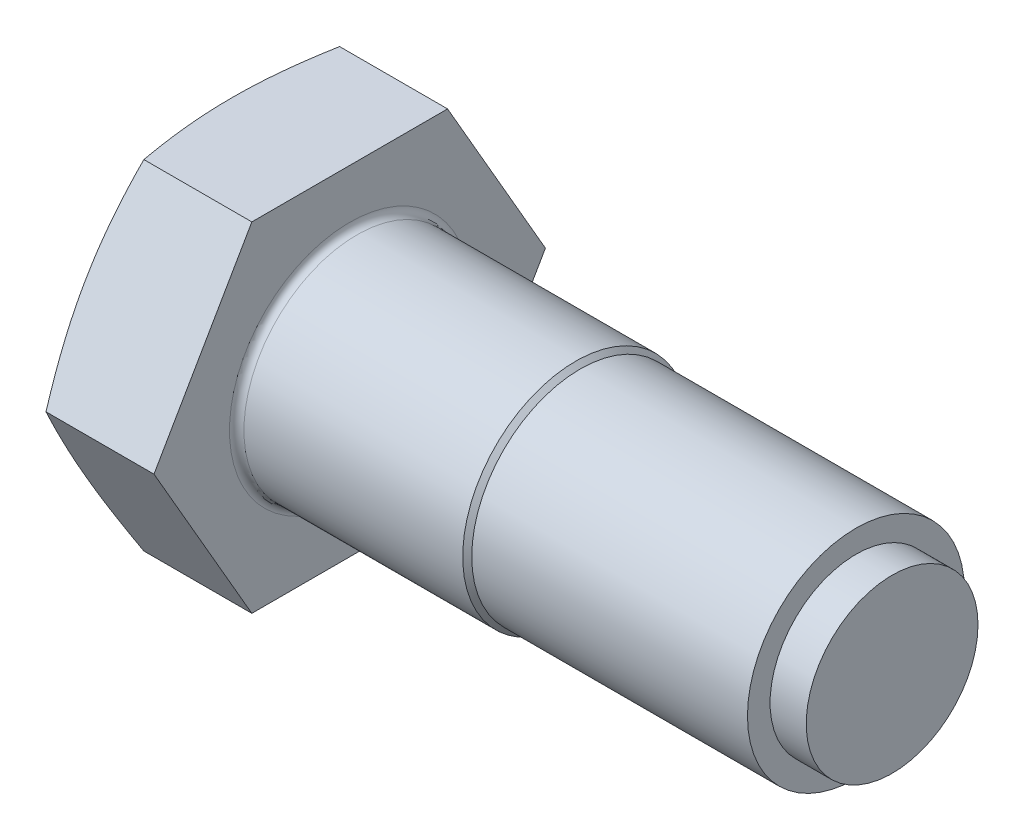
ISO-10303-21;
HEADER;
FILE_DESCRIPTION(('STEP AP214'),'2;1');
FILE_NAME('part.step','',(''),(''),'','','');
FILE_SCHEMA(('AUTOMOTIVE_DESIGN { 1 0 10303 214 1 1 1 1 }'));
ENDSEC;
DATA;
#1=APPLICATION_CONTEXT('core data for automotive mechanical design processes');
#2=APPLICATION_PROTOCOL_DEFINITION('international standard','automotive_design',2000,#1);
#3=PRODUCT_CONTEXT('',#1,'mechanical');
#4=PRODUCT('Part','Part','',(#3));
#5=PRODUCT_RELATED_PRODUCT_CATEGORY('part','',(#4));
#6=PRODUCT_DEFINITION_FORMATION('','',#4);
#7=PRODUCT_DEFINITION_CONTEXT('part definition',#1,'design');
#8=PRODUCT_DEFINITION('design','',#6,#7);
#9=PRODUCT_DEFINITION_SHAPE('','',#8);
#10=(LENGTH_UNIT() NAMED_UNIT(*) SI_UNIT(.MILLI.,.METRE.));
#11=(NAMED_UNIT(*) PLANE_ANGLE_UNIT() SI_UNIT($,.RADIAN.));
#12=(NAMED_UNIT(*) SI_UNIT($,.STERADIAN.) SOLID_ANGLE_UNIT());
#13=UNCERTAINTY_MEASURE_WITH_UNIT(LENGTH_MEASURE(1.E-05),#10,'distance_accuracy_value','');
#14=(GEOMETRIC_REPRESENTATION_CONTEXT(3) GLOBAL_UNCERTAINTY_ASSIGNED_CONTEXT((#13)) GLOBAL_UNIT_ASSIGNED_CONTEXT((#10,
#11,#12)) REPRESENTATION_CONTEXT('',''));
#15=CARTESIAN_POINT('',(0.,0.,0.));
#16=DIRECTION('',(0.,0.,1.));
#17=DIRECTION('',(1.,0.,0.));
#18=AXIS2_PLACEMENT_3D('',#15,#16,#17);
#19=CARTESIAN_POINT('',(26.,-37.5,-21.650635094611));
#20=DIRECTION('',(0.,0.5,0.866025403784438));
#21=DIRECTION('',(0.,-0.866025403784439,0.5));
#22=AXIS2_PLACEMENT_3D('',#19,#20,#21);
#23=PLANE('',#22);
#24=CARTESIAN_POINT('',(2.11153169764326,0.00020000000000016,-43.3013856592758));
#25=CARTESIAN_POINT('',(1.94834883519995,-0.776366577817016,-42.8530347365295));
#26=CARTESIAN_POINT('',(1.79250964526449,-1.55411795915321,-42.4039997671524));
#27=CARTESIAN_POINT('',(1.49712295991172,-3.11200931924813,-41.5045507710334));
#28=CARTESIAN_POINT('',(1.35757701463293,-3.8921495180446,-41.0541366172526));
#29=CARTESIAN_POINT('',(1.09631313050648,-5.45528621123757,-40.1516592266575));
#30=CARTESIAN_POINT('',(0.974608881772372,-6.23828443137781,-39.6995949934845));
#31=CARTESIAN_POINT('',(0.750770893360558,-7.80636299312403,-38.7942644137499));
#32=CARTESIAN_POINT('',(0.648636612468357,-8.59144327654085,-38.3409981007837));
#33=CARTESIAN_POINT('',(0.466305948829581,-10.1560433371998,-37.4376758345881));
#34=CARTESIAN_POINT('',(0.385911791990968,-10.9355457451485,-36.987629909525));
#35=CARTESIAN_POINT('',(0.247079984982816,-12.4960277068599,-36.0866852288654));
#36=CARTESIAN_POINT('',(0.188642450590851,-13.2770072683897,-35.6357864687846));
#37=CARTESIAN_POINT('',(0.0947403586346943,-14.839721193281,-34.7335531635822));
#38=CARTESIAN_POINT('',(0.0592674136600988,-15.6214551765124,-34.2822188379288));
#39=CARTESIAN_POINT('',(0.011897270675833,-17.1854594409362,-33.37924055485));
#40=CARTESIAN_POINT('',(0.,-17.9677297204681,-32.9275965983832));
#41=CARTESIAN_POINT('',(0.,-19.5322702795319,-32.0243086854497));
#42=CARTESIAN_POINT('',(0.0118972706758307,-20.3145405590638,-31.5726647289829));
#43=CARTESIAN_POINT('',(0.059267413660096,-21.8785448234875,-30.6696864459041));
#44=CARTESIAN_POINT('',(0.0947403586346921,-22.660278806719,-30.2183521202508));
#45=CARTESIAN_POINT('',(0.188642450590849,-24.2229927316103,-29.3161188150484));
#46=CARTESIAN_POINT('',(0.247079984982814,-25.0039722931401,-28.8652200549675));
#47=CARTESIAN_POINT('',(0.385911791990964,-26.5644542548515,-27.964275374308));
#48=CARTESIAN_POINT('',(0.466305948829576,-27.3439566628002,-27.5142294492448));
#49=CARTESIAN_POINT('',(0.648636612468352,-28.9085567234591,-26.6109071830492));
#50=CARTESIAN_POINT('',(0.750770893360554,-29.693637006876,-26.1576408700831));
#51=CARTESIAN_POINT('',(0.974608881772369,-31.2617155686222,-25.2523102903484));
#52=CARTESIAN_POINT('',(1.09631313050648,-32.0447137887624,-24.8002460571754));
#53=CARTESIAN_POINT('',(1.35757701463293,-33.6078504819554,-23.8977686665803));
#54=CARTESIAN_POINT('',(1.49712295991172,-34.3879906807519,-23.4473545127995));
#55=CARTESIAN_POINT('',(1.79250964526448,-35.9458820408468,-22.5479055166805));
#56=CARTESIAN_POINT('',(1.94834883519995,-36.723633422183,-22.0988705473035));
#57=CARTESIAN_POINT('',(2.11153169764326,-37.5002,-21.6505196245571));
#58=B_SPLINE_CURVE_WITH_KNOTS('',3,(#24,#25,#26,#27,#28,#29,#30,#31,#32,#33,#34,#35,#36,#37,#38,
#39,#40,#41,#42,#43,#44,#45,#46,#47,#48,#49,#50,#51,#52,#53,#54,#55,#56,#57),.UNSPECIFIED.,.F.,
.F.,(4,2,2,2,2,2,2,2,2,2,2,2,2,2,2,2,4),(0.,2.73430283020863,5.46886559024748,8.20551574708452,
10.9420902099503,13.6528612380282,16.3636465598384,19.073441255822,21.7832275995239,
24.4930139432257,27.2028086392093,29.9135939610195,32.6243649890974,35.3609394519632,
38.0975896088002,40.8321523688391,43.5664551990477),.UNSPECIFIED.);
#59=CARTESIAN_POINT('',(2.11148966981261,0.,-43.301270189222));
#60=VERTEX_POINT('',#59);
#61=CARTESIAN_POINT('',(0.,-18.75,-32.4759526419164));
#62=VERTEX_POINT('',#61);
#63=EDGE_CURVE('E113',#60,#62,#58,.T.);
#64=ORIENTED_EDGE('',*,*,#63,.F.);
#65=DIRECTION('',(-1.,0.,0.));
#66=VECTOR('',#65,1.);
#67=CARTESIAN_POINT('',(26.,0.,-43.3012701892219));
#68=LINE('',#67,#66);
#69=CARTESIAN_POINT('',(26.,0.,-43.3012701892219));
#70=VERTEX_POINT('',#69);
#71=EDGE_CURVE('E142',#70,#60,#68,.T.);
#72=ORIENTED_EDGE('',*,*,#71,.F.);
#73=DIRECTION('',(0.,0.866025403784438,-0.5));
#74=VECTOR('',#73,1.);
#75=CARTESIAN_POINT('',(26.,-37.5,-21.650635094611));
#76=LINE('',#75,#74);
#77=CARTESIAN_POINT('',(26.,-37.5,-21.650635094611));
#78=VERTEX_POINT('',#77);
#79=EDGE_CURVE('E179',#78,#70,#76,.T.);
#80=ORIENTED_EDGE('',*,*,#79,.F.);
#81=DIRECTION('',(-1.,0.,0.));
#82=VECTOR('',#81,1.);
#83=CARTESIAN_POINT('',(26.,-37.5,-21.650635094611));
#84=LINE('',#83,#82);
#85=CARTESIAN_POINT('',(2.11148966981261,-37.5,-21.650635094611));
#86=VERTEX_POINT('',#85);
#87=EDGE_CURVE('E136',#78,#86,#84,.T.);
#88=ORIENTED_EDGE('',*,*,#87,.T.);
#89=EDGE_CURVE('E200',#62,#86,#58,.T.);
#90=ORIENTED_EDGE('',*,*,#89,.F.);
#91=EDGE_LOOP('',(#64,#72,#80,#88,#90));
#92=FACE_BOUND('',#91,.T.);
#93=ADVANCED_FACE('F35',(#92),#23,.F.);
#94=CARTESIAN_POINT('',(26.,0.,-43.3012701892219));
#95=DIRECTION('',(0.,-0.5,0.866025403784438));
#96=DIRECTION('',(0.,-0.866025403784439,-0.5));
#97=AXIS2_PLACEMENT_3D('',#94,#95,#96);
#98=PLANE('',#97);
#99=CARTESIAN_POINT('',(2.11153169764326,37.5002,-21.6505196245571));
#100=CARTESIAN_POINT('',(1.94834883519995,36.723633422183,-22.0988705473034));
#101=CARTESIAN_POINT('',(1.79250964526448,35.9458820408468,-22.5479055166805));
#102=CARTESIAN_POINT('',(1.49712295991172,34.3879906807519,-23.4473545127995));
#103=CARTESIAN_POINT('',(1.35757701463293,33.6078504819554,-23.8977686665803));
#104=CARTESIAN_POINT('',(1.09631313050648,32.0447137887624,-24.8002460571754));
#105=CARTESIAN_POINT('',(0.97460888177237,31.2617155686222,-25.2523102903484));
#106=CARTESIAN_POINT('',(0.750770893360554,29.693637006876,-26.157640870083));
#107=CARTESIAN_POINT('',(0.64863661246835,28.9085567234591,-26.6109071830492));
#108=CARTESIAN_POINT('',(0.466305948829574,27.3439566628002,-27.5142294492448));
#109=CARTESIAN_POINT('',(0.385911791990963,26.5644542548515,-27.9642753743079));
#110=CARTESIAN_POINT('',(0.247079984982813,25.0039722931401,-28.8652200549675));
#111=CARTESIAN_POINT('',(0.188642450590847,24.2229927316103,-29.3161188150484));
#112=CARTESIAN_POINT('',(0.0947403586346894,22.660278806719,-30.2183521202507));
#113=CARTESIAN_POINT('',(0.0592674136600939,21.8785448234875,-30.6696864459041));
#114=CARTESIAN_POINT('',(0.0118972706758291,20.3145405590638,-31.5726647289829));
#115=CARTESIAN_POINT('',(0.,19.5322702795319,-32.0243086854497));
#116=CARTESIAN_POINT('',(0.,17.9677297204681,-32.9275965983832));
#117=CARTESIAN_POINT('',(0.0118972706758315,17.1854594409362,-33.37924055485));
#118=CARTESIAN_POINT('',(0.0592674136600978,15.6214551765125,-34.2822188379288));
#119=CARTESIAN_POINT('',(0.0947403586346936,14.839721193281,-34.7335531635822));
#120=CARTESIAN_POINT('',(0.18864245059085,13.2770072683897,-35.6357864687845));
#121=CARTESIAN_POINT('',(0.247079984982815,12.4960277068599,-36.0866852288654));
#122=CARTESIAN_POINT('',(0.385911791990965,10.9355457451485,-36.987629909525));
#123=CARTESIAN_POINT('',(0.466305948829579,10.1560433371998,-37.4376758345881));
#124=CARTESIAN_POINT('',(0.648636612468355,8.59144327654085,-38.3409981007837));
#125=CARTESIAN_POINT('',(0.750770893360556,7.80636299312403,-38.7942644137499));
#126=CARTESIAN_POINT('',(0.974608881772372,6.23828443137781,-39.6995949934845));
#127=CARTESIAN_POINT('',(1.09631313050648,5.45528621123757,-40.1516592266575));
#128=CARTESIAN_POINT('',(1.35757701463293,3.8921495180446,-41.0541366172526));
#129=CARTESIAN_POINT('',(1.49712295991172,3.11200931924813,-41.5045507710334));
#130=CARTESIAN_POINT('',(1.79250964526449,1.5541179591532,-42.4039997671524));
#131=CARTESIAN_POINT('',(1.94834883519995,0.776366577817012,-42.8530347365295));
#132=CARTESIAN_POINT('',(2.11153169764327,-0.000200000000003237,-43.3013856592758));
#133=B_SPLINE_CURVE_WITH_KNOTS('',3,(#99,#100,#101,#102,#103,#104,#105,#106,#107,#108,#109,#110,
#111,#112,#113,#114,#115,#116,#117,#118,#119,#120,#121,#122,#123,#124,#125,#126,#127,#128,#129,
#130,#131,#132),.UNSPECIFIED.,.F.,.F.,(4,2,2,2,2,2,2,2,2,2,2,2,2,2,2,2,4),(0.,2.73430283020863,
5.46886559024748,8.20551574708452,10.9420902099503,13.6528612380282,16.3636465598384,
19.073441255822,21.7832275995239,24.4930139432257,27.2028086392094,29.9135939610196,
32.6243649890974,35.3609394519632,38.0975896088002,40.8321523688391,43.5664551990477),.UNSPECIFIED.);
#134=CARTESIAN_POINT('',(2.11148966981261,37.5,-21.650635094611));
#135=VERTEX_POINT('',#134);
#136=CARTESIAN_POINT('',(0.,18.75,-32.4759526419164));
#137=VERTEX_POINT('',#136);
#138=EDGE_CURVE('E252',#135,#137,#133,.T.);
#139=ORIENTED_EDGE('',*,*,#138,.F.);
#140=DIRECTION('',(-1.,0.,0.));
#141=VECTOR('',#140,1.);
#142=CARTESIAN_POINT('',(26.,37.5,-21.650635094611));
#143=LINE('',#142,#141);
#144=CARTESIAN_POINT('',(26.,37.5,-21.650635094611));
#145=VERTEX_POINT('',#144);
#146=EDGE_CURVE('E133',#145,#135,#143,.T.);
#147=ORIENTED_EDGE('',*,*,#146,.F.);
#148=DIRECTION('',(0.,0.866025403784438,0.5));
#149=VECTOR('',#148,1.);
#150=CARTESIAN_POINT('',(26.,0.,-43.3012701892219));
#151=LINE('',#150,#149);
#152=EDGE_CURVE('E182',#70,#145,#151,.T.);
#153=ORIENTED_EDGE('',*,*,#152,.F.);
#154=ORIENTED_EDGE('',*,*,#71,.T.);
#155=EDGE_CURVE('E125',#137,#60,#133,.T.);
#156=ORIENTED_EDGE('',*,*,#155,.F.);
#157=EDGE_LOOP('',(#139,#147,#153,#154,#156));
#158=FACE_BOUND('',#157,.T.);
#159=ADVANCED_FACE('F258',(#158),#98,.F.);
#160=CARTESIAN_POINT('',(26.,37.5,-21.650635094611));
#161=DIRECTION('',(0.,-1.,0.));
#162=DIRECTION('',(0.,0.,-1.));
#163=AXIS2_PLACEMENT_3D('',#160,#161,#162);
#164=PLANE('',#163);
#165=CARTESIAN_POINT('',(11.282963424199,37.5,-57.3232688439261));
#166=CARTESIAN_POINT('',(11.024590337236,37.5,-56.4749638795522));
#167=CARTESIAN_POINT('',(10.7677760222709,37.5,-55.6261826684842));
#168=CARTESIAN_POINT('',(10.2576222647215,37.5,-53.9275714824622));
#169=CARTESIAN_POINT('',(10.0042828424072,37.5,-53.077741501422));
#170=CARTESIAN_POINT('',(9.50141967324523,37.5,-51.376880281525));
#171=CARTESIAN_POINT('',(9.25189622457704,37.5,-50.5258489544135));
#172=CARTESIAN_POINT('',(8.75710860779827,37.5,-48.8225512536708));
#173=CARTESIAN_POINT('',(8.51184443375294,37.5,-47.9702848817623));
#174=CARTESIAN_POINT('',(7.78221792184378,37.5,-45.4082825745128));
#175=CARTESIAN_POINT('',(7.30496198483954,37.5,-43.6965119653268));
#176=CARTESIAN_POINT('',(6.37392745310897,37.5,-40.2666094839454));
#177=CARTESIAN_POINT('',(5.92014843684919,37.5,-38.5484777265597));
#178=CARTESIAN_POINT('',(5.04731568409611,37.5,-35.1259308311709));
#179=CARTESIAN_POINT('',(4.6279027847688,37.5,-33.4216077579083));
#180=CARTESIAN_POINT('',(3.82478394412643,37.5,-30.0044823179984));
#181=CARTESIAN_POINT('',(3.4410786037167,37.5,-28.2916798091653));
#182=CARTESIAN_POINT('',(2.71832262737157,37.5,-24.8572060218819));
#183=CARTESIAN_POINT('',(2.37925675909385,37.5,-23.1355379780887));
#184=CARTESIAN_POINT('',(1.75610060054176,37.5,-19.6822231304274));
#185=CARTESIAN_POINT('',(1.47200846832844,37.5,-17.950576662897));
#186=CARTESIAN_POINT('',(0.998482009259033,37.5,-14.6722197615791));
#187=CARTESIAN_POINT('',(0.802005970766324,37.5,-13.1265424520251));
#188=CARTESIAN_POINT('',(0.55253782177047,37.5,-10.8032079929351));
#189=CARTESIAN_POINT('',(0.4769217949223,37.5,-10.0279459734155));
#190=CARTESIAN_POINT('',(0.341622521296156,37.5,-8.47604005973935));
#191=CARTESIAN_POINT('',(0.281938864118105,37.5,-7.69939620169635));
#192=CARTESIAN_POINT('',(0.179275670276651,37.5,-6.14553840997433));
#193=CARTESIAN_POINT('',(0.136284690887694,37.5,-5.3683252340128));
#194=CARTESIAN_POINT('',(0.0675039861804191,37.5,-3.81313497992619));
#195=CARTESIAN_POINT('',(0.0417142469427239,37.5,-3.03515790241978));
#196=CARTESIAN_POINT('',(0.00768279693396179,37.5,-1.47882133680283));
#197=CARTESIAN_POINT('',(-0.000558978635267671,37.5,-0.700461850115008));
#198=CARTESIAN_POINT('',(0.000617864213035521,37.5,0.856243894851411));
#199=CARTESIAN_POINT('',(0.0100364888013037,37.5,1.63459015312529));
#200=CARTESIAN_POINT('',(0.0464978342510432,37.5,3.19481544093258));
#201=CARTESIAN_POINT('',(0.073629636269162,37.5,3.97669238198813));
#202=CARTESIAN_POINT('',(0.145235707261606,37.5,5.53964794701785));
#203=CARTESIAN_POINT('',(0.189709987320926,37.5,6.32072657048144));
#204=CARTESIAN_POINT('',(0.295422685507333,37.5,7.88174709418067));
#205=CARTESIAN_POINT('',(0.356661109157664,37.5,8.66168899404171));
#206=CARTESIAN_POINT('',(0.495143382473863,37.5,10.2201570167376));
#207=CARTESIAN_POINT('',(0.572387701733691,37.5,10.9986830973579));
#208=CARTESIAN_POINT('',(0.82696097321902,37.5,13.3330727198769));
#209=CARTESIAN_POINT('',(1.02704372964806,37.5,14.8865086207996));
#210=CARTESIAN_POINT('',(1.36661768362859,37.5,17.2107200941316));
#211=CARTESIAN_POINT('',(1.48638624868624,37.5,17.984479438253));
#212=CARTESIAN_POINT('',(1.7380414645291,37.5,19.5300374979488));
#213=CARTESIAN_POINT('',(1.86992819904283,37.5,20.3018361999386));
#214=CARTESIAN_POINT('',(2.29676781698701,37.5,22.6957641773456));
#215=CARTESIAN_POINT('',(2.61077959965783,37.5,24.3145091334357));
#216=CARTESIAN_POINT('',(3.27921084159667,37.5,27.5436571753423));
#217=CARTESIAN_POINT('',(3.63363334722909,37.5,29.1540596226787));
#218=CARTESIAN_POINT('',(4.37545248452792,37.5,32.3677074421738));
#219=CARTESIAN_POINT('',(4.76285869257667,37.5,33.9709505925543));
#220=CARTESIAN_POINT('',(5.56434097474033,37.5,37.170681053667));
#221=CARTESIAN_POINT('',(5.97841640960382,37.5,38.7671685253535));
#222=CARTESIAN_POINT('',(6.82879828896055,37.5,41.9563873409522));
#223=CARTESIAN_POINT('',(7.26513260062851,37.5,43.5491112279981));
#224=CARTESIAN_POINT('',(8.15555081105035,37.5,46.7295828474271));
#225=CARTESIAN_POINT('',(8.60963478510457,37.5,48.3173305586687));
#226=CARTESIAN_POINT('',(9.53230359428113,37.5,51.4883089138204));
#227=CARTESIAN_POINT('',(10.0008859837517,37.5,53.0715402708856));
#228=CARTESIAN_POINT('',(10.9501050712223,37.5,56.2343755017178));
#229=CARTESIAN_POINT('',(11.4307417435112,37.5,57.8139793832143));
#230=CARTESIAN_POINT('',(12.3966996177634,37.5,60.9526684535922));
#231=CARTESIAN_POINT('',(12.88191051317,37.5,62.511787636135));
#232=CARTESIAN_POINT('',(13.8605974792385,37.5,65.6274272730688));
#233=CARTESIAN_POINT('',(14.3540735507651,37.5,67.1839477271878));
#234=CARTESIAN_POINT('',(15.3480495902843,37.5,70.2948210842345));
#235=CARTESIAN_POINT('',(15.8485498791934,37.5,71.8491738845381));
#236=CARTESIAN_POINT('',(16.8555226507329,37.5,74.955944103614));
#237=CARTESIAN_POINT('',(17.3619951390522,37.5,76.5083615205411));
#238=CARTESIAN_POINT('',(18.3781339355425,37.5,79.6056240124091));
#239=CARTESIAN_POINT('',(18.8877808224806,37.5,81.1504754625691));
#240=CARTESIAN_POINT('',(19.9114724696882,37.5,84.2387208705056));
#241=CARTESIAN_POINT('',(20.4255172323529,37.5,85.7821148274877));
#242=CARTESIAN_POINT('',(21.4573827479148,37.5,88.8674988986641));
#243=CARTESIAN_POINT('',(21.9752031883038,37.5,90.4094891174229));
#244=CARTESIAN_POINT('',(23.0141947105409,37.5,93.492336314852));
#245=CARTESIAN_POINT('',(23.5353657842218,37.5,95.0331932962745));
#246=CARTESIAN_POINT('',(24.057979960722,37.5,96.5735594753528));
#247=B_SPLINE_CURVE_WITH_KNOTS('',3,(#165,#166,#167,#168,#169,#170,#171,#172,#173,#174,#175,
#176,#177,#178,#179,#180,#181,#182,#183,#184,#185,#186,#187,#188,#189,#190,#191,#192,#193,#194,
#195,#196,#197,#198,#199,#200,#201,#202,#203,#204,#205,#206,#207,#208,#209,#210,#211,#212,#213,
#214,#215,#216,#217,#218,#219,#220,#221,#222,#223,#224,#225,#226,#227,#228,#229,#230,#231,#232,
#233,#234,#235,#236,#237,#238,#239,#240,#241,#242,#243,#244,#245,#246),.UNSPECIFIED.,.F.,.F.,(4,
2,2,2,2,2,2,2,2,2,2,2,2,2,2,2,2,2,2,2,2,2,2,2,2,2,2,2,2,2,2,2,2,2,2,2,2,2,2,2,4),(0.,
2.66033914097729,5.32069379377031,7.98125527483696,10.6418130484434,15.9728434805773,
21.3037781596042,26.5689852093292,31.8342808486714,37.0977751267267,42.3610930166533,
47.0342926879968,49.3709773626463,51.7076018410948,54.0426217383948,56.3776397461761,
58.7126491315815,61.0476593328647,63.3945039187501,65.741350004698,68.0881968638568,
70.4351125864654,75.1326675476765,77.4815217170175,79.8303921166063,84.7764495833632,
89.7228801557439,94.6707517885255,99.6185048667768,104.572612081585,109.526740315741,
114.480037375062,119.433323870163,124.331923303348,129.230523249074,134.129347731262,
139.028176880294,143.908410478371,148.788646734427,153.668483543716,158.548308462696),.UNSPECIFIED.);
#248=CARTESIAN_POINT('',(2.11148966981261,37.5,21.650635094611));
#249=VERTEX_POINT('',#248);
#250=CARTESIAN_POINT('',(0.,37.5,0.));
#251=VERTEX_POINT('',#250);
#252=EDGE_CURVE('E50',#249,#251,#247,.F.);
#253=ORIENTED_EDGE('',*,*,#252,.F.);
#254=DIRECTION('',(-1.,0.,0.));
#255=VECTOR('',#254,1.);
#256=CARTESIAN_POINT('',(26.,37.5,21.650635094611));
#257=LINE('',#256,#255);
#258=CARTESIAN_POINT('',(26.,37.5,21.650635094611));
#259=VERTEX_POINT('',#258);
#260=EDGE_CURVE('E130',#259,#249,#257,.T.);
#261=ORIENTED_EDGE('',*,*,#260,.F.);
#262=DIRECTION('',(0.,0.,1.));
#263=VECTOR('',#262,1.);
#264=CARTESIAN_POINT('',(26.,37.5,-21.650635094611));
#265=LINE('',#264,#263);
#266=EDGE_CURVE('E188',#145,#259,#265,.T.);
#267=ORIENTED_EDGE('',*,*,#266,.F.);
#268=ORIENTED_EDGE('',*,*,#146,.T.);
#269=EDGE_CURVE('E253',#251,#135,#247,.F.);
#270=ORIENTED_EDGE('',*,*,#269,.F.);
#271=EDGE_LOOP('',(#253,#261,#267,#268,#270));
#272=FACE_BOUND('',#271,.T.);
#273=ADVANCED_FACE('F261',(#272),#164,.F.);
#274=CARTESIAN_POINT('',(26.,37.5,21.650635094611));
#275=DIRECTION('',(0.,-0.5,-0.866025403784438));
#276=DIRECTION('',(0.,0.866025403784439,-0.5));
#277=AXIS2_PLACEMENT_3D('',#274,#275,#276);
#278=PLANE('',#277);
#279=CARTESIAN_POINT('',(2.11153169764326,-0.000199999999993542,43.3013856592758));
#280=CARTESIAN_POINT('',(1.94834883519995,0.776366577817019,42.8530347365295));
#281=CARTESIAN_POINT('',(1.79250964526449,1.55411795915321,42.4039997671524));
#282=CARTESIAN_POINT('',(1.49712295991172,3.11200931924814,41.5045507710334));
#283=CARTESIAN_POINT('',(1.35757701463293,3.89214951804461,41.0541366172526));
#284=CARTESIAN_POINT('',(1.09631313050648,5.45528621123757,40.1516592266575));
#285=CARTESIAN_POINT('',(0.97460888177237,6.23828443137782,39.6995949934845));
#286=CARTESIAN_POINT('',(0.750770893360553,7.80636299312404,38.7942644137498));
#287=CARTESIAN_POINT('',(0.64863661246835,8.59144327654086,38.3409981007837));
#288=CARTESIAN_POINT('',(0.466305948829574,10.1560433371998,37.4376758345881));
#289=CARTESIAN_POINT('',(0.385911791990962,10.9355457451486,36.987629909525));
#290=CARTESIAN_POINT('',(0.247079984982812,12.4960277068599,36.0866852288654));
#291=CARTESIAN_POINT('',(0.188642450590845,13.2770072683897,35.6357864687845));
#292=CARTESIAN_POINT('',(0.094740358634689,14.839721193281,34.7335531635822));
#293=CARTESIAN_POINT('',(0.0592674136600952,15.6214551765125,34.2822188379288));
#294=CARTESIAN_POINT('',(0.0118972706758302,17.1854594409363,33.37924055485));
#295=CARTESIAN_POINT('',(0.,17.9677297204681,32.9275965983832));
#296=CARTESIAN_POINT('',(0.,19.5322702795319,32.0243086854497));
#297=CARTESIAN_POINT('',(0.0118972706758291,20.3145405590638,31.5726647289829));
#298=CARTESIAN_POINT('',(0.0592674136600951,21.8785448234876,30.6696864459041));
#299=CARTESIAN_POINT('',(0.0947403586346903,22.660278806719,30.2183521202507));
#300=CARTESIAN_POINT('',(0.188642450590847,24.2229927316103,29.3161188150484));
#301=CARTESIAN_POINT('',(0.247079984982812,25.0039722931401,28.8652200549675));
#302=CARTESIAN_POINT('',(0.385911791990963,26.5644542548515,27.9642753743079));
#303=CARTESIAN_POINT('',(0.466305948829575,27.3439566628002,27.5142294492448));
#304=CARTESIAN_POINT('',(0.648636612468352,28.9085567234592,26.6109071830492));
#305=CARTESIAN_POINT('',(0.750770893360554,29.693637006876,26.157640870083));
#306=CARTESIAN_POINT('',(0.97460888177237,31.2617155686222,25.2523102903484));
#307=CARTESIAN_POINT('',(1.09631313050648,32.0447137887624,24.8002460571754));
#308=CARTESIAN_POINT('',(1.35757701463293,33.6078504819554,23.8977686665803));
#309=CARTESIAN_POINT('',(1.49712295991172,34.3879906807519,23.4473545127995));
#310=CARTESIAN_POINT('',(1.79250964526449,35.9458820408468,22.5479055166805));
#311=CARTESIAN_POINT('',(1.94834883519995,36.723633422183,22.0988705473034));
#312=CARTESIAN_POINT('',(2.11153169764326,37.5002,21.6505196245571));
#313=B_SPLINE_CURVE_WITH_KNOTS('',3,(#279,#280,#281,#282,#283,#284,#285,#286,#287,#288,#289,
#290,#291,#292,#293,#294,#295,#296,#297,#298,#299,#300,#301,#302,#303,#304,#305,#306,#307,#308,
#309,#310,#311,#312),.UNSPECIFIED.,.F.,.F.,(4,2,2,2,2,2,2,2,2,2,2,2,2,2,2,2,4),(0.,
2.73430283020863,5.46886559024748,8.20551574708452,10.9420902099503,13.6528612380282,
16.3636465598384,19.073441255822,21.7832275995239,24.4930139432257,27.2028086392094,
29.9135939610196,32.6243649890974,35.3609394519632,38.0975896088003,40.8321523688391,
43.5664551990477),.UNSPECIFIED.);
#314=CARTESIAN_POINT('',(2.11148966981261,0.,43.301270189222));
#315=VERTEX_POINT('',#314);
#316=CARTESIAN_POINT('',(0.,18.75,32.4759526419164));
#317=VERTEX_POINT('',#316);
#318=EDGE_CURVE('E58',#315,#317,#313,.T.);
#319=ORIENTED_EDGE('',*,*,#318,.F.);
#320=DIRECTION('',(-1.,0.,0.));
#321=VECTOR('',#320,1.);
#322=CARTESIAN_POINT('',(26.,0.,43.3012701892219));
#323=LINE('',#322,#321);
#324=CARTESIAN_POINT('',(26.,0.,43.3012701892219));
#325=VERTEX_POINT('',#324);
#326=EDGE_CURVE('E121',#325,#315,#323,.T.);
#327=ORIENTED_EDGE('',*,*,#326,.F.);
#328=DIRECTION('',(0.,-0.866025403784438,0.5));
#329=VECTOR('',#328,1.);
#330=CARTESIAN_POINT('',(26.,37.5,21.650635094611));
#331=LINE('',#330,#329);
#332=EDGE_CURVE('E190',#259,#325,#331,.T.);
#333=ORIENTED_EDGE('',*,*,#332,.F.);
#334=ORIENTED_EDGE('',*,*,#260,.T.);
#335=EDGE_CURVE('E124',#317,#249,#313,.T.);
#336=ORIENTED_EDGE('',*,*,#335,.F.);
#337=EDGE_LOOP('',(#319,#327,#333,#334,#336));
#338=FACE_BOUND('',#337,.T.);
#339=ADVANCED_FACE('F119',(#338),#278,.F.);
#340=CARTESIAN_POINT('',(26.,0.,43.3012701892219));
#341=DIRECTION('',(0.,0.5,-0.866025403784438));
#342=DIRECTION('',(0.,0.866025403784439,0.5));
#343=AXIS2_PLACEMENT_3D('',#340,#341,#342);
#344=PLANE('',#343);
#345=CARTESIAN_POINT('',(2.11153169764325,-37.5002,21.6505196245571));
#346=CARTESIAN_POINT('',(1.94834883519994,-36.723633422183,22.0988705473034));
#347=CARTESIAN_POINT('',(1.79250964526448,-35.9458820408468,22.5479055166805));
#348=CARTESIAN_POINT('',(1.49712295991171,-34.3879906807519,23.4473545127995));
#349=CARTESIAN_POINT('',(1.35757701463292,-33.6078504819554,23.8977686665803));
#350=CARTESIAN_POINT('',(1.09631313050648,-32.0447137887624,24.8002460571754));
#351=CARTESIAN_POINT('',(0.974608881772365,-31.2617155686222,25.2523102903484));
#352=CARTESIAN_POINT('',(0.750770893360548,-29.693637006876,26.157640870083));
#353=CARTESIAN_POINT('',(0.648636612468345,-28.9085567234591,26.6109071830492));
#354=CARTESIAN_POINT('',(0.466305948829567,-27.3439566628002,27.5142294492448));
#355=CARTESIAN_POINT('',(0.385911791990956,-26.5644542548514,27.9642753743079));
#356=CARTESIAN_POINT('',(0.247079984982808,-25.0039722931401,28.8652200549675));
#357=CARTESIAN_POINT('',(0.188642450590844,-24.2229927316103,29.3161188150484));
#358=CARTESIAN_POINT('',(0.0947403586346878,-22.660278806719,30.2183521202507));
#359=CARTESIAN_POINT('',(0.0592674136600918,-21.8785448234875,30.6696864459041));
#360=CARTESIAN_POINT('',(0.0118972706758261,-20.3145405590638,31.5726647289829));
#361=CARTESIAN_POINT('',(0.,-19.5322702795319,32.0243086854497));
#362=CARTESIAN_POINT('',(0.,-17.9677297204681,32.9275965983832));
#363=CARTESIAN_POINT('',(0.0118972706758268,-17.1854594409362,33.37924055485));
#364=CARTESIAN_POINT('',(0.0592674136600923,-15.6214551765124,34.2822188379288));
#365=CARTESIAN_POINT('',(0.0947403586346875,-14.839721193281,34.7335531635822));
#366=CARTESIAN_POINT('',(0.188642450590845,-13.2770072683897,35.6357864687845));
#367=CARTESIAN_POINT('',(0.247079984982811,-12.4960277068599,36.0866852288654));
#368=CARTESIAN_POINT('',(0.385911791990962,-10.9355457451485,36.987629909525));
#369=CARTESIAN_POINT('',(0.466305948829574,-10.1560433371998,37.4376758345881));
#370=CARTESIAN_POINT('',(0.648636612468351,-8.59144327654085,38.3409981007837));
#371=CARTESIAN_POINT('',(0.750770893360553,-7.80636299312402,38.7942644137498));
#372=CARTESIAN_POINT('',(0.974608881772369,-6.2382844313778,39.6995949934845));
#373=CARTESIAN_POINT('',(1.09631313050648,-5.45528621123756,40.1516592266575));
#374=CARTESIAN_POINT('',(1.35757701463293,-3.89214951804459,41.0541366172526));
#375=CARTESIAN_POINT('',(1.49712295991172,-3.11200931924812,41.5045507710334));
#376=CARTESIAN_POINT('',(1.79250964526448,-1.5541179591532,42.4039997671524));
#377=CARTESIAN_POINT('',(1.94834883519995,-0.776366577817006,42.8530347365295));
#378=CARTESIAN_POINT('',(2.11153169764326,0.000200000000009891,43.3013856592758));
#379=B_SPLINE_CURVE_WITH_KNOTS('',3,(#345,#346,#347,#348,#349,#350,#351,#352,#353,#354,#355,
#356,#357,#358,#359,#360,#361,#362,#363,#364,#365,#366,#367,#368,#369,#370,#371,#372,#373,#374,
#375,#376,#377,#378),.UNSPECIFIED.,.F.,.F.,(4,2,2,2,2,2,2,2,2,2,2,2,2,2,2,2,4),(0.,
2.73430283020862,5.46886559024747,8.20551574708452,10.9420902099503,13.6528612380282,
16.3636465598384,19.073441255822,21.7832275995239,24.4930139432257,27.2028086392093,
29.9135939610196,32.6243649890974,35.3609394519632,38.0975896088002,40.8321523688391,
43.5664551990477),.UNSPECIFIED.);
#380=CARTESIAN_POINT('',(2.11148966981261,-37.5,21.650635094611));
#381=VERTEX_POINT('',#380);
#382=CARTESIAN_POINT('',(0.,-18.75,32.4759526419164));
#383=VERTEX_POINT('',#382);
#384=EDGE_CURVE('E115',#381,#383,#379,.T.);
#385=ORIENTED_EDGE('',*,*,#384,.F.);
#386=DIRECTION('',(-1.,0.,0.));
#387=VECTOR('',#386,1.);
#388=CARTESIAN_POINT('',(26.,-37.5,21.650635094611));
#389=LINE('',#388,#387);
#390=CARTESIAN_POINT('',(26.,-37.5,21.650635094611));
#391=VERTEX_POINT('',#390);
#392=EDGE_CURVE('E131',#391,#381,#389,.T.);
#393=ORIENTED_EDGE('',*,*,#392,.F.);
#394=DIRECTION('',(0.,-0.866025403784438,-0.5));
#395=VECTOR('',#394,1.);
#396=CARTESIAN_POINT('',(26.,0.,43.3012701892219));
#397=LINE('',#396,#395);
#398=EDGE_CURVE('E129',#325,#391,#397,.T.);
#399=ORIENTED_EDGE('',*,*,#398,.F.);
#400=ORIENTED_EDGE('',*,*,#326,.T.);
#401=EDGE_CURVE('E105',#383,#315,#379,.T.);
#402=ORIENTED_EDGE('',*,*,#401,.F.);
#403=EDGE_LOOP('',(#385,#393,#399,#400,#402));
#404=FACE_BOUND('',#403,.T.);
#405=ADVANCED_FACE('F127',(#404),#344,.F.);
#406=CARTESIAN_POINT('',(26.,-37.5,21.650635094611));
#407=DIRECTION('',(0.,1.,0.));
#408=DIRECTION('',(0.,0.,1.));
#409=AXIS2_PLACEMENT_3D('',#406,#407,#408);
#410=PLANE('',#409);
#411=CARTESIAN_POINT('',(11.282963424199,-37.5,-57.3232688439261));
#412=CARTESIAN_POINT('',(11.024590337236,-37.5,-56.4749638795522));
#413=CARTESIAN_POINT('',(10.7677760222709,-37.5,-55.6261826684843));
#414=CARTESIAN_POINT('',(10.2576222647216,-37.5,-53.9275714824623));
#415=CARTESIAN_POINT('',(10.0042828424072,-37.5,-53.077741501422));
#416=CARTESIAN_POINT('',(9.50141967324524,-37.5,-51.376880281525));
#417=CARTESIAN_POINT('',(9.25189622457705,-37.5,-50.5258489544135));
#418=CARTESIAN_POINT('',(8.75710860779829,-37.5,-48.8225512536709));
#419=CARTESIAN_POINT('',(8.51184443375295,-37.5,-47.9702848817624));
#420=CARTESIAN_POINT('',(7.78221792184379,-37.5,-45.4082825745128));
#421=CARTESIAN_POINT('',(7.30496198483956,-37.5,-43.6965119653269));
#422=CARTESIAN_POINT('',(6.37392745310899,-37.5,-40.2666094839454));
#423=CARTESIAN_POINT('',(5.92014843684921,-37.5,-38.5484777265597));
#424=CARTESIAN_POINT('',(5.04731568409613,-37.5,-35.1259308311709));
#425=CARTESIAN_POINT('',(4.62790278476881,-37.5,-33.4216077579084));
#426=CARTESIAN_POINT('',(3.82478394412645,-37.5,-30.0044823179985));
#427=CARTESIAN_POINT('',(3.44107860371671,-37.5,-28.2916798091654));
#428=CARTESIAN_POINT('',(2.71832262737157,-37.5,-24.8572060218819));
#429=CARTESIAN_POINT('',(2.37925675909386,-37.5,-23.1355379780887));
#430=CARTESIAN_POINT('',(1.75610060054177,-37.5,-19.6822231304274));
#431=CARTESIAN_POINT('',(1.47200846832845,-37.5,-17.950576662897));
#432=CARTESIAN_POINT('',(0.998482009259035,-37.5,-14.6722197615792));
#433=CARTESIAN_POINT('',(0.802005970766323,-37.5,-13.1265424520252));
#434=CARTESIAN_POINT('',(0.552537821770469,-37.5,-10.8032079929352));
#435=CARTESIAN_POINT('',(0.476921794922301,-37.5,-10.0279459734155));
#436=CARTESIAN_POINT('',(0.341622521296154,-37.5,-8.47604005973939));
#437=CARTESIAN_POINT('',(0.2819388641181,-37.5,-7.69939620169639));
#438=CARTESIAN_POINT('',(0.179275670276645,-37.5,-6.14553840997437));
#439=CARTESIAN_POINT('',(0.13628469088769,-37.5,-5.36832523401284));
#440=CARTESIAN_POINT('',(0.0675039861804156,-37.5,-3.81313497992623));
#441=CARTESIAN_POINT('',(0.0417142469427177,-37.5,-3.03515790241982));
#442=CARTESIAN_POINT('',(0.00768279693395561,-37.5,-1.47882133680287));
#443=CARTESIAN_POINT('',(-0.00055897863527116,-37.5,-0.700461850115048));
#444=CARTESIAN_POINT('',(0.000617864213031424,-37.5,0.856243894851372));
#445=CARTESIAN_POINT('',(0.0100364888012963,-37.5,1.63459015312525));
#446=CARTESIAN_POINT('',(0.0464978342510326,-37.5,3.19481544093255));
#447=CARTESIAN_POINT('',(0.0736296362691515,-37.5,3.9766923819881));
#448=CARTESIAN_POINT('',(0.145235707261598,-37.5,5.53964794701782));
#449=CARTESIAN_POINT('',(0.18970998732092,-37.5,6.32072657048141));
#450=CARTESIAN_POINT('',(0.295422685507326,-37.5,7.88174709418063));
#451=CARTESIAN_POINT('',(0.356661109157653,-37.5,8.66168899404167));
#452=CARTESIAN_POINT('',(0.49514338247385,-37.5,10.2201570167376));
#453=CARTESIAN_POINT('',(0.57238770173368,-37.5,10.9986830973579));
#454=CARTESIAN_POINT('',(0.826960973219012,-37.5,13.3330727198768));
#455=CARTESIAN_POINT('',(1.02704372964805,-37.5,14.8865086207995));
#456=CARTESIAN_POINT('',(1.36661768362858,-37.5,17.2107200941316));
#457=CARTESIAN_POINT('',(1.48638624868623,-37.5,17.984479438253));
#458=CARTESIAN_POINT('',(1.73804146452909,-37.5,19.5300374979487));
#459=CARTESIAN_POINT('',(1.86992819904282,-37.5,20.3018361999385));
#460=CARTESIAN_POINT('',(2.296767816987,-37.5,22.6957641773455));
#461=CARTESIAN_POINT('',(2.61077959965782,-37.5,24.3145091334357));
#462=CARTESIAN_POINT('',(3.27921084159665,-37.5,27.5436571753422));
#463=CARTESIAN_POINT('',(3.63363334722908,-37.5,29.1540596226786));
#464=CARTESIAN_POINT('',(4.37545248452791,-37.5,32.3677074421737));
#465=CARTESIAN_POINT('',(4.76285869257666,-37.5,33.9709505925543));
#466=CARTESIAN_POINT('',(5.56434097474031,-37.5,37.170681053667));
#467=CARTESIAN_POINT('',(5.9784164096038,-37.5,38.7671685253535));
#468=CARTESIAN_POINT('',(6.82879828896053,-37.5,41.9563873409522));
#469=CARTESIAN_POINT('',(7.26513260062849,-37.5,43.549111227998));
#470=CARTESIAN_POINT('',(8.15555081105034,-37.5,46.729582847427));
#471=CARTESIAN_POINT('',(8.60963478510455,-37.5,48.3173305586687));
#472=CARTESIAN_POINT('',(9.53230359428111,-37.5,51.4883089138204));
#473=CARTESIAN_POINT('',(10.0008859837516,-37.5,53.0715402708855));
#474=CARTESIAN_POINT('',(10.9501050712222,-37.5,56.2343755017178));
#475=CARTESIAN_POINT('',(11.4307417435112,-37.5,57.8139793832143));
#476=CARTESIAN_POINT('',(12.3966996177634,-37.5,60.9526684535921));
#477=CARTESIAN_POINT('',(12.88191051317,-37.5,62.511787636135));
#478=CARTESIAN_POINT('',(13.8605974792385,-37.5,65.6274272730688));
#479=CARTESIAN_POINT('',(14.3540735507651,-37.5,67.1839477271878));
#480=CARTESIAN_POINT('',(15.3480495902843,-37.5,70.2948210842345));
#481=CARTESIAN_POINT('',(15.8485498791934,-37.5,71.8491738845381));
#482=CARTESIAN_POINT('',(16.8555226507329,-37.5,74.955944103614));
#483=CARTESIAN_POINT('',(17.3619951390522,-37.5,76.5083615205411));
#484=CARTESIAN_POINT('',(18.3781339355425,-37.5,79.605624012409));
#485=CARTESIAN_POINT('',(18.8877808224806,-37.5,81.1504754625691));
#486=CARTESIAN_POINT('',(19.9114724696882,-37.5,84.2387208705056));
#487=CARTESIAN_POINT('',(20.4255172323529,-37.5,85.7821148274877));
#488=CARTESIAN_POINT('',(21.4573827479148,-37.5,88.8674988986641));
#489=CARTESIAN_POINT('',(21.9752031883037,-37.5,90.4094891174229));
#490=CARTESIAN_POINT('',(23.0141947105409,-37.5,93.492336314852));
#491=CARTESIAN_POINT('',(23.5353657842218,-37.5,95.0331932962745));
#492=CARTESIAN_POINT('',(24.057979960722,-37.5,96.5735594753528));
#493=B_SPLINE_CURVE_WITH_KNOTS('',3,(#411,#412,#413,#414,#415,#416,#417,#418,#419,#420,#421,
#422,#423,#424,#425,#426,#427,#428,#429,#430,#431,#432,#433,#434,#435,#436,#437,#438,#439,#440,
#441,#442,#443,#444,#445,#446,#447,#448,#449,#450,#451,#452,#453,#454,#455,#456,#457,#458,#459,
#460,#461,#462,#463,#464,#465,#466,#467,#468,#469,#470,#471,#472,#473,#474,#475,#476,#477,#478,
#479,#480,#481,#482,#483,#484,#485,#486,#487,#488,#489,#490,#491,#492),.UNSPECIFIED.,.F.,.F.,(4,
2,2,2,2,2,2,2,2,2,2,2,2,2,2,2,2,2,2,2,2,2,2,2,2,2,2,2,2,2,2,2,2,2,2,2,2,2,2,2,4),(0.,
2.66033914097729,5.32069379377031,7.98125527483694,10.6418130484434,15.9728434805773,
21.3037781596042,26.5689852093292,31.8342808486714,37.0977751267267,42.3610930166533,
47.0342926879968,49.3709773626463,51.7076018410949,54.0426217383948,56.3776397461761,
58.7126491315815,61.0476593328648,63.3945039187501,65.741350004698,68.0881968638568,
70.4351125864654,75.1326675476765,77.4815217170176,79.8303921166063,84.7764495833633,
89.722880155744,94.6707517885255,99.6185048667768,104.572612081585,109.526740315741,
114.480037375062,119.433323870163,124.331923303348,129.230523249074,134.129347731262,
139.028176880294,143.908410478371,148.788646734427,153.668483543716,158.548308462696),.UNSPECIFIED.);
#494=CARTESIAN_POINT('',(0.,-37.5,0.));
#495=VERTEX_POINT('',#494);
#496=EDGE_CURVE('E208',#86,#495,#493,.T.);
#497=ORIENTED_EDGE('',*,*,#496,.F.);
#498=ORIENTED_EDGE('',*,*,#87,.F.);
#499=DIRECTION('',(0.,0.,-1.));
#500=VECTOR('',#499,1.);
#501=CARTESIAN_POINT('',(26.,-37.5,21.650635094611));
#502=LINE('',#501,#500);
#503=EDGE_CURVE('E193',#391,#78,#502,.T.);
#504=ORIENTED_EDGE('',*,*,#503,.F.);
#505=ORIENTED_EDGE('',*,*,#392,.T.);
#506=EDGE_CURVE('E209',#495,#381,#493,.T.);
#507=ORIENTED_EDGE('',*,*,#506,.F.);
#508=EDGE_LOOP('',(#497,#498,#504,#505,#507));
#509=FACE_BOUND('',#508,.T.);
#510=ADVANCED_FACE('F205',(#509),#410,.F.);
#511=CARTESIAN_POINT('',(333.882250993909,0.,0.));
#512=DIRECTION('',(-1.,0.,0.));
#513=DIRECTION('',(0.,0.,1.));
#514=AXIS2_PLACEMENT_3D('',#511,#512,#513);
#515=CYLINDRICAL_SURFACE('',#514,24.);
#516=CARTESIAN_POINT('',(77.,0.,0.));
#517=DIRECTION('',(1.,0.,0.));
#518=DIRECTION('',(0.,0.,-1.));
#519=AXIS2_PLACEMENT_3D('',#516,#517,#518);
#520=CIRCLE('',#519,24.);
#521=CARTESIAN_POINT('',(77.,0.,-24.));
#522=VERTEX_POINT('',#521);
#523=EDGE_CURVE('E13',#522,#522,#520,.T.);
#524=ORIENTED_EDGE('',*,*,#523,.T.);
#525=EDGE_LOOP('',(#524));
#526=FACE_BOUND('',#525,.T.);
#527=CARTESIAN_POINT('',(138.,0.,0.));
#528=DIRECTION('',(1.,0.,0.));
#529=DIRECTION('',(0.,0.,-1.));
#530=AXIS2_PLACEMENT_3D('',#527,#528,#529);
#531=CIRCLE('',#530,24.);
#532=CARTESIAN_POINT('',(138.,0.,-24.));
#533=VERTEX_POINT('',#532);
#534=EDGE_CURVE('E146',#533,#533,#531,.T.);
#535=ORIENTED_EDGE('',*,*,#534,.F.);
#536=EDGE_LOOP('',(#535));
#537=FACE_BOUND('',#536,.T.);
#538=ADVANCED_FACE('F273',(#526,#537),#515,.T.);
#539=CARTESIAN_POINT('',(26.,0.,-43.301270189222));
#540=DIRECTION('',(1.,0.,0.));
#541=DIRECTION('',(0.,0.,-1.));
#542=AXIS2_PLACEMENT_3D('',#539,#540,#541);
#543=PLANE('',#542);
#544=CARTESIAN_POINT('',(26.,0.,0.));
#545=DIRECTION('',(1.,0.,0.));
#546=DIRECTION('',(0.,0.,-1.));
#547=AXIS2_PLACEMENT_3D('',#544,#545,#546);
#548=CIRCLE('',#547,26.6);
#549=CARTESIAN_POINT('',(26.,0.,-26.6));
#550=VERTEX_POINT('',#549);
#551=EDGE_CURVE('E43',#550,#550,#548,.F.);
#552=ORIENTED_EDGE('',*,*,#551,.T.);
#553=EDGE_LOOP('',(#552));
#554=FACE_BOUND('',#553,.T.);
#555=ORIENTED_EDGE('',*,*,#79,.T.);
#556=ORIENTED_EDGE('',*,*,#152,.T.);
#557=ORIENTED_EDGE('',*,*,#266,.T.);
#558=ORIENTED_EDGE('',*,*,#332,.T.);
#559=ORIENTED_EDGE('',*,*,#398,.T.);
#560=ORIENTED_EDGE('',*,*,#503,.T.);
#561=EDGE_LOOP('',(#555,#556,#557,#558,#559,#560));
#562=FACE_BOUND('',#561,.T.);
#563=ADVANCED_FACE('F160',(#554,#562),#543,.T.);
#564=CARTESIAN_POINT('',(76.,0.,0.));
#565=DIRECTION('',(-1.,0.,0.));
#566=DIRECTION('',(0.,0.,1.));
#567=AXIS2_PLACEMENT_3D('',#564,#565,#566);
#568=CYLINDRICAL_SURFACE('',#567,25.);
#569=CARTESIAN_POINT('',(27.6,0.,0.));
#570=DIRECTION('',(1.,0.,0.));
#571=DIRECTION('',(0.,0.,-1.));
#572=AXIS2_PLACEMENT_3D('',#569,#570,#571);
#573=CIRCLE('',#572,25.);
#574=CARTESIAN_POINT('',(27.6,0.,-25.));
#575=VERTEX_POINT('',#574);
#576=EDGE_CURVE('E155',#575,#575,#573,.T.);
#577=ORIENTED_EDGE('',*,*,#576,.T.);
#578=EDGE_LOOP('',(#577));
#579=FACE_BOUND('',#578,.T.);
#580=CARTESIAN_POINT('',(76.,0.,0.));
#581=DIRECTION('',(1.,0.,0.));
#582=DIRECTION('',(0.,0.,-1.));
#583=AXIS2_PLACEMENT_3D('',#580,#581,#582);
#584=CIRCLE('',#583,25.);
#585=CARTESIAN_POINT('',(76.,0.,-25.));
#586=VERTEX_POINT('',#585);
#587=EDGE_CURVE('E149',#586,#586,#584,.T.);
#588=ORIENTED_EDGE('',*,*,#587,.F.);
#589=EDGE_LOOP('',(#588));
#590=FACE_BOUND('',#589,.T.);
#591=ADVANCED_FACE('F171',(#579,#590),#568,.T.);
#592=CARTESIAN_POINT('',(138.,0.,0.));
#593=DIRECTION('',(1.,0.,0.));
#594=DIRECTION('',(0.,0.,-1.));
#595=AXIS2_PLACEMENT_3D('',#592,#593,#594);
#596=PLANE('',#595);
#597=CARTESIAN_POINT('',(138.,0.,0.));
#598=DIRECTION('',(1.,0.,0.));
#599=DIRECTION('',(0.,0.,-1.));
#600=AXIS2_PLACEMENT_3D('',#597,#598,#599);
#601=CIRCLE('',#600,19.);
#602=CARTESIAN_POINT('',(138.,0.,-19.));
#603=VERTEX_POINT('',#602);
#604=EDGE_CURVE('E150',#603,#603,#601,.T.);
#605=ORIENTED_EDGE('',*,*,#604,.F.);
#606=EDGE_LOOP('',(#605));
#607=FACE_BOUND('',#606,.T.);
#608=ORIENTED_EDGE('',*,*,#534,.T.);
#609=EDGE_LOOP('',(#608));
#610=FACE_BOUND('',#609,.T.);
#611=ADVANCED_FACE('F174',(#607,#610),#596,.T.);
#612=CARTESIAN_POINT('',(138.,0.,0.));
#613=DIRECTION('',(1.,0.,0.));
#614=DIRECTION('',(0.,0.,-1.));
#615=AXIS2_PLACEMENT_3D('',#612,#613,#614);
#616=CYLINDRICAL_SURFACE('',#615,19.);
#617=ORIENTED_EDGE('',*,*,#604,.T.);
#618=EDGE_LOOP('',(#617));
#619=FACE_BOUND('',#618,.T.);
#620=CARTESIAN_POINT('',(146.,0.,0.));
#621=DIRECTION('',(1.,0.,0.));
#622=DIRECTION('',(0.,0.,-1.));
#623=AXIS2_PLACEMENT_3D('',#620,#621,#622);
#624=CIRCLE('',#623,19.);
#625=CARTESIAN_POINT('',(146.,0.,-19.));
#626=VERTEX_POINT('',#625);
#627=EDGE_CURVE('E416',#626,#626,#624,.T.);
#628=ORIENTED_EDGE('',*,*,#627,.F.);
#629=EDGE_LOOP('',(#628));
#630=FACE_BOUND('',#629,.T.);
#631=ADVANCED_FACE('F233',(#619,#630),#616,.T.);
#632=CARTESIAN_POINT('',(146.,0.,-43.301270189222));
#633=DIRECTION('',(1.,0.,0.));
#634=DIRECTION('',(0.,0.,-1.));
#635=AXIS2_PLACEMENT_3D('',#632,#633,#634);
#636=PLANE('',#635);
#637=ORIENTED_EDGE('',*,*,#627,.T.);
#638=EDGE_LOOP('',(#637));
#639=FACE_BOUND('',#638,.T.);
#640=ADVANCED_FACE('F313',(#639),#636,.T.);
#641=CARTESIAN_POINT('',(0.,0.,0.));
#642=DIRECTION('',(1.,0.,0.));
#643=DIRECTION('',(0.,0.,-1.));
#644=AXIS2_PLACEMENT_3D('',#641,#642,#643);
#645=CONICAL_SURFACE('',#644,37.5,1.22173047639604);
#646=ORIENTED_EDGE('',*,*,#155,.T.);
#647=ORIENTED_EDGE('',*,*,#63,.T.);
#648=CARTESIAN_POINT('',(0.,0.,0.));
#649=DIRECTION('',(1.,0.,0.));
#650=DIRECTION('',(0.,0.,-1.));
#651=AXIS2_PLACEMENT_3D('',#648,#649,#650);
#652=CIRCLE('',#651,37.5);
#653=EDGE_CURVE('E145',#62,#137,#652,.T.);
#654=ORIENTED_EDGE('',*,*,#653,.T.);
#655=EDGE_LOOP('',(#646,#647,#654));
#656=FACE_BOUND('',#655,.T.);
#657=ADVANCED_FACE('F307',(#656),#645,.T.);
#658=ORIENTED_EDGE('',*,*,#89,.T.);
#659=ORIENTED_EDGE('',*,*,#496,.T.);
#660=EDGE_CURVE('E153',#495,#62,#652,.T.);
#661=ORIENTED_EDGE('',*,*,#660,.T.);
#662=EDGE_LOOP('',(#658,#659,#661));
#663=FACE_BOUND('',#662,.T.);
#664=ADVANCED_FACE('F312',(#663),#645,.T.);
#665=ORIENTED_EDGE('',*,*,#384,.T.);
#666=EDGE_CURVE('E428',#383,#495,#652,.T.);
#667=ORIENTED_EDGE('',*,*,#666,.T.);
#668=ORIENTED_EDGE('',*,*,#506,.T.);
#669=EDGE_LOOP('',(#665,#667,#668));
#670=FACE_BOUND('',#669,.T.);
#671=ADVANCED_FACE('F231',(#670),#645,.T.);
#672=ORIENTED_EDGE('',*,*,#318,.T.);
#673=EDGE_CURVE('E108',#317,#383,#652,.T.);
#674=ORIENTED_EDGE('',*,*,#673,.T.);
#675=ORIENTED_EDGE('',*,*,#401,.T.);
#676=EDGE_LOOP('',(#672,#674,#675));
#677=FACE_BOUND('',#676,.T.);
#678=ADVANCED_FACE('F106',(#677),#645,.T.);
#679=ORIENTED_EDGE('',*,*,#252,.T.);
#680=CARTESIAN_POINT('',(0.,0.,0.));
#681=DIRECTION('',(-1.,0.,0.));
#682=DIRECTION('',(0.,0.,1.));
#683=AXIS2_PLACEMENT_3D('',#680,#681,#682);
#684=CIRCLE('',#683,37.5);
#685=EDGE_CURVE('E212',#317,#251,#684,.T.);
#686=ORIENTED_EDGE('',*,*,#685,.F.);
#687=ORIENTED_EDGE('',*,*,#335,.T.);
#688=EDGE_LOOP('',(#679,#686,#687));
#689=FACE_BOUND('',#688,.T.);
#690=ADVANCED_FACE('F226',(#689),#645,.T.);
#691=ORIENTED_EDGE('',*,*,#269,.T.);
#692=ORIENTED_EDGE('',*,*,#138,.T.);
#693=EDGE_CURVE('E154',#137,#251,#652,.T.);
#694=ORIENTED_EDGE('',*,*,#693,.T.);
#695=EDGE_LOOP('',(#691,#692,#694));
#696=FACE_BOUND('',#695,.T.);
#697=ADVANCED_FACE('F230',(#696),#645,.T.);
#698=CARTESIAN_POINT('',(0.,0.,-43.301270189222));
#699=DIRECTION('',(1.,0.,0.));
#700=DIRECTION('',(0.,0.,-1.));
#701=AXIS2_PLACEMENT_3D('',#698,#699,#700);
#702=PLANE('',#701);
#703=ORIENTED_EDGE('',*,*,#693,.F.);
#704=ORIENTED_EDGE('',*,*,#653,.F.);
#705=ORIENTED_EDGE('',*,*,#660,.F.);
#706=ORIENTED_EDGE('',*,*,#666,.F.);
#707=ORIENTED_EDGE('',*,*,#673,.F.);
#708=ORIENTED_EDGE('',*,*,#685,.T.);
#709=EDGE_LOOP('',(#703,#704,#705,#706,#707,#708));
#710=FACE_BOUND('',#709,.T.);
#711=ADVANCED_FACE('F167',(#710),#702,.F.);
#712=CARTESIAN_POINT('',(27.6,0.,0.));
#713=DIRECTION('',(1.,0.,0.));
#714=DIRECTION('',(0.,0.,-1.));
#715=AXIS2_PLACEMENT_3D('',#712,#713,#714);
#716=TOROIDAL_SURFACE('',#715,26.6,1.6);
#717=ORIENTED_EDGE('',*,*,#551,.F.);
#718=EDGE_LOOP('',(#717));
#719=FACE_BOUND('',#718,.T.);
#720=ORIENTED_EDGE('',*,*,#576,.F.);
#721=EDGE_LOOP('',(#720));
#722=FACE_BOUND('',#721,.T.);
#723=ADVANCED_FACE('F163',(#719,#722),#716,.F.);
#724=CARTESIAN_POINT('',(77.,0.,0.));
#725=DIRECTION('',(-1.,0.,0.));
#726=DIRECTION('',(0.,0.,1.));
#727=AXIS2_PLACEMENT_3D('',#724,#725,#726);
#728=CONICAL_SURFACE('',#727,24.,0.785398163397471);
#729=ORIENTED_EDGE('',*,*,#587,.T.);
#730=EDGE_LOOP('',(#729));
#731=FACE_BOUND('',#730,.T.);
#732=ORIENTED_EDGE('',*,*,#523,.F.);
#733=EDGE_LOOP('',(#732));
#734=FACE_BOUND('',#733,.T.);
#735=ADVANCED_FACE('F166',(#731,#734),#728,.T.);
#736=CLOSED_SHELL('',(#93,#159,#273,#339,#405,#510,#538,#563,#591,#611,#631,#640,#657,#664,#671,
#678,#690,#697,#711,#723,#735));
#737=MANIFOLD_SOLID_BREP('B2',#736);
#738=ADVANCED_BREP_SHAPE_REPRESENTATION('',(#18,#737),#14);
#739=SHAPE_DEFINITION_REPRESENTATION(#9,#738);
ENDSEC;
END-ISO-10303-21;
